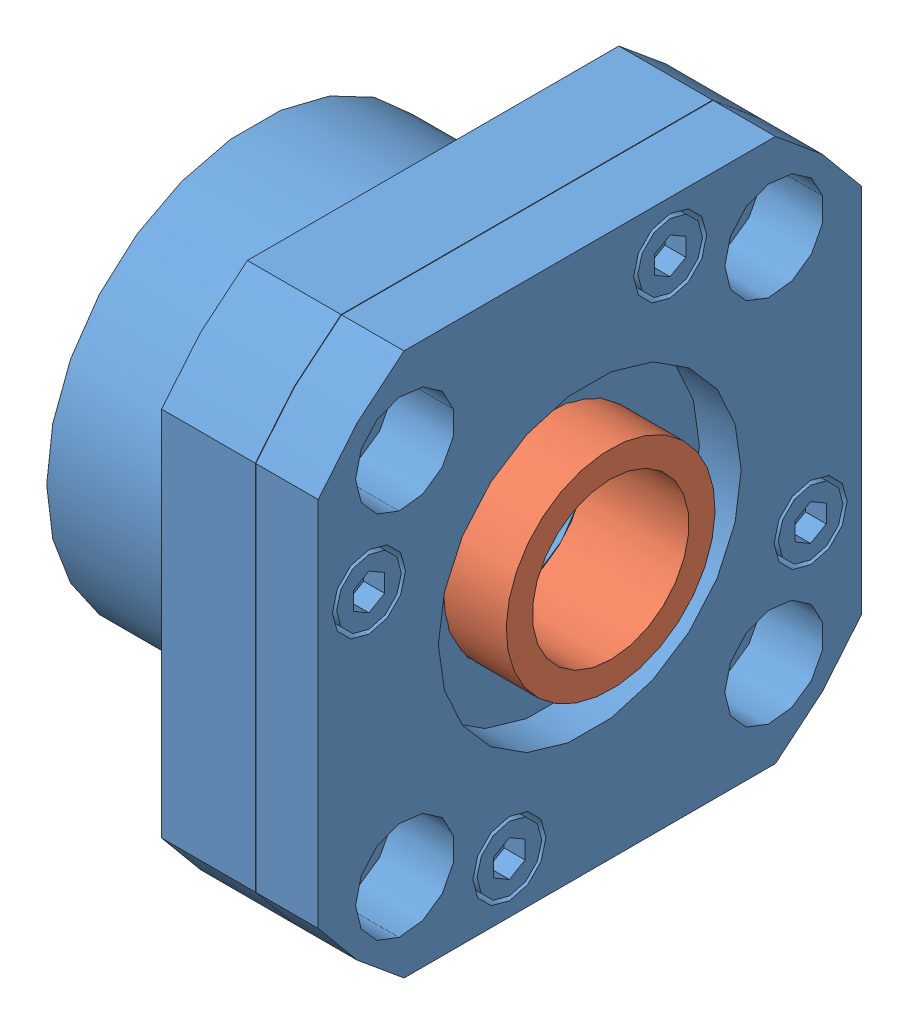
SolidWorks assembly BRWR15.sldasm, configuration Default (file format 5000). Lengths in mm.
Overall size (34 52 52).
3 component instances, 3 part files, 4 mates.
Components (placement in the parent):
- BRWR15_b-1: BRWR15_b.sldprt [Default] at origin size (32 52 52)
- BRW15_c-1: BRW15_c.sldprt [Default] at (24 0 0) x (0 -0.88008 -0.474825) z (1 0 0) size (20 20 10)
- BRW15_n-1: BRW15_n.sldprt [Default] at (67 0 0) x (1 0 0) z (0 -0.707107 0.707107) (suppressed, hidden)
Mates (geometry in assembly coordinates):
- Concentric1: concentric aligned: cylinder of BRWR15_b-1 through (17 0 0) axis (-1 0 0) radius 20; cylinder of BRW15_c-1 through (34 0 0) axis (-1 0 0) radius 7.5
- Coincident1: coincident anti-aligned: plane of BRWR15_b-1 through (24 7.5 0) normal (1 0 0); plane of BRW15_c-1 through (24 0 0) normal (-1 0 0)
- Distance1: distance = 32 mm anti-aligned: plane of BRW15_c-1 through (34 0 0) normal (1 0 0); plane of BRW15_n-1 through (66 0 0) normal (-1 0 0)
- Concentric2: concentric aligned: cylinder of BRW15_c-1 through (34 0 0) axis (-1 0 0) radius 7.5; cylinder of BRW15_n-1 through (76 0 0) axis (-1 0 0) radius 6.9585
